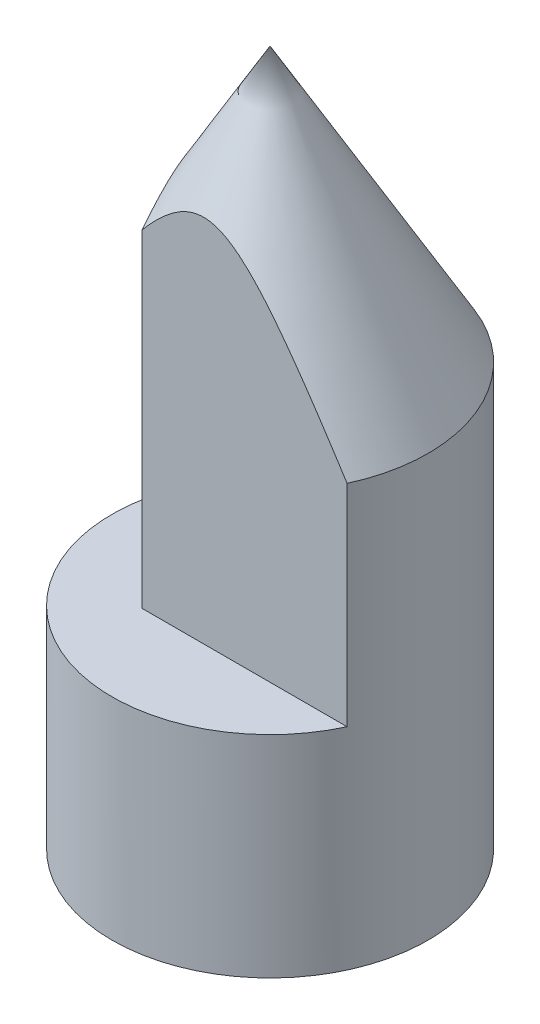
ISO-10303-21;
HEADER;
FILE_DESCRIPTION(('STEP AP214'),'2;1');
FILE_NAME('part.step','',(''),(''),'','','');
FILE_SCHEMA(('AUTOMOTIVE_DESIGN { 1 0 10303 214 1 1 1 1 }'));
ENDSEC;
DATA;
#1=APPLICATION_CONTEXT('core data for automotive mechanical design processes');
#2=APPLICATION_PROTOCOL_DEFINITION('international standard','automotive_design',2000,#1);
#3=PRODUCT_CONTEXT('',#1,'mechanical');
#4=PRODUCT('Part','Part','',(#3));
#5=PRODUCT_RELATED_PRODUCT_CATEGORY('part','',(#4));
#6=PRODUCT_DEFINITION_FORMATION('','',#4);
#7=PRODUCT_DEFINITION_CONTEXT('part definition',#1,'design');
#8=PRODUCT_DEFINITION('design','',#6,#7);
#9=PRODUCT_DEFINITION_SHAPE('','',#8);
#10=(LENGTH_UNIT() NAMED_UNIT(*) SI_UNIT(.MILLI.,.METRE.));
#11=(NAMED_UNIT(*) PLANE_ANGLE_UNIT() SI_UNIT($,.RADIAN.));
#12=(NAMED_UNIT(*) SI_UNIT($,.STERADIAN.) SOLID_ANGLE_UNIT());
#13=UNCERTAINTY_MEASURE_WITH_UNIT(LENGTH_MEASURE(1.E-05),#10,'distance_accuracy_value','');
#14=(GEOMETRIC_REPRESENTATION_CONTEXT(3) GLOBAL_UNCERTAINTY_ASSIGNED_CONTEXT((#13)) GLOBAL_UNIT_ASSIGNED_CONTEXT((#10,
#11,#12)) REPRESENTATION_CONTEXT('',''));
#15=CARTESIAN_POINT('',(0.,0.,0.));
#16=DIRECTION('',(0.,0.,1.));
#17=DIRECTION('',(1.,0.,0.));
#18=AXIS2_PLACEMENT_3D('',#15,#16,#17);
#19=CARTESIAN_POINT('',(0.,40.,0.));
#20=DIRECTION('',(0.,-1.,0.));
#21=DIRECTION('',(0.,0.,-1.));
#22=AXIS2_PLACEMENT_3D('',#19,#20,#21);
#23=CYLINDRICAL_SURFACE('',#22,15.);
#24=CARTESIAN_POINT('',(0.,0.,0.));
#25=DIRECTION('',(0.,1.,0.));
#26=DIRECTION('',(0.,0.,1.));
#27=AXIS2_PLACEMENT_3D('',#24,#25,#26);
#28=CIRCLE('',#27,15.);
#29=CARTESIAN_POINT('',(0.,0.,15.));
#30=VERTEX_POINT('',#29);
#31=EDGE_CURVE('E276',#30,#30,#28,.T.);
#32=ORIENTED_EDGE('',*,*,#31,.T.);
#33=EDGE_LOOP('',(#32));
#34=FACE_BOUND('',#33,.T.);
#35=DIRECTION('',(0.,-1.,0.));
#36=VECTOR('',#35,1.);
#37=CARTESIAN_POINT('',(13.6114090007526,40.,6.303137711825));
#38=LINE('',#37,#36);
#39=CARTESIAN_POINT('',(13.6114090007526,20.,6.303137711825));
#40=VERTEX_POINT('',#39);
#41=CARTESIAN_POINT('',(13.6114090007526,40.,6.303137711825));
#42=VERTEX_POINT('',#41);
#43=EDGE_CURVE('E274',#40,#42,#38,.F.);
#44=ORIENTED_EDGE('',*,*,#43,.F.);
#45=CARTESIAN_POINT('',(0.,20.,0.));
#46=DIRECTION('',(0.,1.,0.));
#47=DIRECTION('',(0.,0.,1.));
#48=AXIS2_PLACEMENT_3D('',#45,#46,#47);
#49=CIRCLE('',#48,15.);
#50=CARTESIAN_POINT('',(-6.38000784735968,20.,-13.5755478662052));
#51=VERTEX_POINT('',#50);
#52=EDGE_CURVE('E12',#51,#40,#49,.T.);
#53=ORIENTED_EDGE('',*,*,#52,.F.);
#54=DIRECTION('',(0.,-1.,0.));
#55=VECTOR('',#54,1.);
#56=CARTESIAN_POINT('',(-6.38000784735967,40.,-13.5755478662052));
#57=LINE('',#56,#55);
#58=CARTESIAN_POINT('',(-6.38000784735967,40.,-13.5755478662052));
#59=VERTEX_POINT('',#58);
#60=EDGE_CURVE('E263',#59,#51,#57,.T.);
#61=ORIENTED_EDGE('',*,*,#60,.F.);
#62=CARTESIAN_POINT('',(0.,40.,0.));
#63=DIRECTION('',(0.,1.,0.));
#64=DIRECTION('',(0.,0.,1.));
#65=AXIS2_PLACEMENT_3D('',#62,#63,#64);
#66=CIRCLE('',#65,15.);
#67=EDGE_CURVE('E277',#42,#59,#66,.T.);
#68=ORIENTED_EDGE('',*,*,#67,.F.);
#69=EDGE_LOOP('',(#44,#53,#61,#68));
#70=FACE_BOUND('',#69,.T.);
#71=ADVANCED_FACE('F211',(#34,#70),#23,.T.);
#72=CARTESIAN_POINT('',(0.,65.9807621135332,0.));
#73=DIRECTION('',(0.,-1.,0.));
#74=DIRECTION('',(0.,0.,-1.));
#75=AXIS2_PLACEMENT_3D('',#72,#73,#74);
#76=CONICAL_SURFACE('',#75,0.,0.523598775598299);
#77=CARTESIAN_POINT('',(0.,65.9807621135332,0.));
#78=VERTEX_POINT('',#77);
#79=VERTEX_LOOP('',#78);
#80=FACE_BOUND('',#79,.T.);
#81=CARTESIAN_POINT('',(-33.9912809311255,6.10246743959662,6.303137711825));
#82=CARTESIAN_POINT('',(-33.5140429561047,6.91520945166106,6.303137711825));
#83=CARTESIAN_POINT('',(-33.0365595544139,7.72780733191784,6.303137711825));
#84=CARTESIAN_POINT('',(-32.0810270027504,9.35267068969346,6.303137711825));
#85=CARTESIAN_POINT('',(-31.6029778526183,10.1649361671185,6.303137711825));
#86=CARTESIAN_POINT('',(-30.1678376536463,12.6012217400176,6.303137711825));
#87=CARTESIAN_POINT('',(-29.2097859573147,14.224676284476,6.303137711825));
#88=CARTESIAN_POINT('',(-27.2890141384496,17.4717105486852,6.303137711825));
#89=CARTESIAN_POINT('',(-26.326289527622,19.0952876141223,6.303137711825));
#90=CARTESIAN_POINT('',(-24.3962025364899,22.3396209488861,6.303137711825));
#91=CARTESIAN_POINT('',(-23.4288402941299,23.9603773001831,6.303137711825));
#92=CARTESIAN_POINT('',(-21.9550116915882,26.4181362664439,6.303137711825));
#93=CARTESIAN_POINT('',(-21.4509909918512,27.2566053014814,6.303137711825));
#94=CARTESIAN_POINT('',(-20.4407321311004,28.9322065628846,6.303137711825));
#95=CARTESIAN_POINT('',(-19.9344939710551,29.7693387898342,6.303137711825));
#96=CARTESIAN_POINT('',(-18.9192168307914,31.4420118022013,6.303137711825));
#97=CARTESIAN_POINT('',(-18.4101775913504,32.2775524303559,6.303137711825));
#98=CARTESIAN_POINT('',(-17.3886162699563,33.9464979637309,6.303137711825));
#99=CARTESIAN_POINT('',(-16.8760942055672,34.7799028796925,6.303137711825));
#100=CARTESIAN_POINT('',(-15.8469183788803,36.4433204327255,6.303137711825));
#101=CARTESIAN_POINT('',(-15.3302678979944,37.2733350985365,6.303137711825));
#102=CARTESIAN_POINT('',(-14.2910196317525,38.9296331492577,6.303137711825));
#103=CARTESIAN_POINT('',(-13.7684218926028,39.7559165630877,6.303137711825));
#104=CARTESIAN_POINT('',(-12.9784353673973,40.9913662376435,6.303137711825));
#105=CARTESIAN_POINT('',(-12.7141102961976,41.402491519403,6.303137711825));
#106=CARTESIAN_POINT('',(-12.1830226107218,42.2231638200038,6.303137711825));
#107=CARTESIAN_POINT('',(-11.9162600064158,42.632710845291,6.303137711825));
#108=CARTESIAN_POINT('',(-11.3798248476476,43.4498721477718,6.303137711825));
#109=CARTESIAN_POINT('',(-11.1101524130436,43.8574865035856,6.303137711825));
#110=CARTESIAN_POINT('',(-10.5672632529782,44.6703458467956,6.303137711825));
#111=CARTESIAN_POINT('',(-10.2940465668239,45.0755908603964,6.303137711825));
#112=CARTESIAN_POINT('',(-9.82810984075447,45.7586689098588,6.303137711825));
#113=CARTESIAN_POINT('',(-9.63653079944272,46.0372800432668,6.303137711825));
#114=CARTESIAN_POINT('',(-9.25092007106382,46.5928071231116,6.303137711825));
#115=CARTESIAN_POINT('',(-9.05688835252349,46.8697230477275,6.303137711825));
#116=CARTESIAN_POINT('',(-8.66586699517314,47.4216178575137,6.303137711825));
#117=CARTESIAN_POINT('',(-8.46887626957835,47.6965959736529,6.303137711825));
#118=CARTESIAN_POINT('',(-8.07146266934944,48.2440596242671,6.303137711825));
#119=CARTESIAN_POINT('',(-7.87103983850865,48.5165451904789,6.303137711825));
#120=CARTESIAN_POINT('',(-7.46657186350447,49.057749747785,6.303137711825));
#121=CARTESIAN_POINT('',(-7.26253713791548,49.326476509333,6.303137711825));
#122=CARTESIAN_POINT('',(-6.84946379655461,49.8600534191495,6.303137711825));
#123=CARTESIAN_POINT('',(-6.64042535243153,50.124903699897,6.303137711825));
#124=CARTESIAN_POINT('',(-6.21626814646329,50.6494718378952,6.303137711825));
#125=CARTESIAN_POINT('',(-6.00115268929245,50.9091923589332,6.303137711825));
#126=CARTESIAN_POINT('',(-5.56318595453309,51.4220040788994,6.303137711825));
#127=CARTESIAN_POINT('',(-5.34033590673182,51.6750963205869,6.303137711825));
#128=CARTESIAN_POINT('',(-4.94809416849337,52.1030545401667,6.303137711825));
#129=CARTESIAN_POINT('',(-4.7810792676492,52.2800937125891,6.303137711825));
#130=CARTESIAN_POINT('',(-4.44075893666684,52.6281231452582,6.303137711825));
#131=CARTESIAN_POINT('',(-4.26745230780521,52.7991122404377,6.303137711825));
#132=CARTESIAN_POINT('',(-3.91334524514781,53.1329885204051,6.303137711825));
#133=CARTESIAN_POINT('',(-3.73254916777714,53.2958802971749,6.303137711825));
#134=CARTESIAN_POINT('',(-3.36177859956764,53.610843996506,6.303137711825));
#135=CARTESIAN_POINT('',(-3.17180803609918,53.7629204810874,6.303137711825));
#136=CARTESIAN_POINT('',(-2.85712687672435,53.9956251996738,6.303137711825));
#137=CARTESIAN_POINT('',(-2.73591486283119,54.0809558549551,6.303137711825));
#138=CARTESIAN_POINT('',(-2.4889626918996,54.2447359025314,6.303137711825));
#139=CARTESIAN_POINT('',(-2.36322204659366,54.3231845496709,6.303137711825));
#140=CARTESIAN_POINT('',(-1.97878795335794,54.5456924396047,6.303137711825));
#141=CARTESIAN_POINT('',(-1.71234343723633,54.6773290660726,6.303137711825));
#142=CARTESIAN_POINT('',(-1.33293911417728,54.8233261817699,6.303137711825));
#143=CARTESIAN_POINT('',(-1.22823785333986,54.8595356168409,6.303137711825));
#144=CARTESIAN_POINT('',(-1.01639500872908,54.9238536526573,6.303137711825));
#145=CARTESIAN_POINT('',(-0.909254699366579,54.9519663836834,6.303137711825));
#146=CARTESIAN_POINT('',(-0.693119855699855,54.9991659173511,6.303137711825));
#147=CARTESIAN_POINT('',(-0.584127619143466,55.0182631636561,6.303137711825));
#148=CARTESIAN_POINT('',(-0.36487137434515,55.0467696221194,6.303137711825));
#149=CARTESIAN_POINT('',(-0.254607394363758,55.0561790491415,6.303137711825));
#150=CARTESIAN_POINT('',(-0.0331570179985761,55.0649476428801,6.303137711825));
#151=CARTESIAN_POINT('',(0.0780312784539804,55.0642594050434,6.303137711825));
#152=CARTESIAN_POINT('',(0.299874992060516,55.0527465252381,6.303137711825));
#153=CARTESIAN_POINT('',(0.410530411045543,55.0419219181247,6.303137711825));
#154=CARTESIAN_POINT('',(0.630489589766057,55.0105697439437,6.303137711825));
#155=CARTESIAN_POINT('',(0.739792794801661,54.990038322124,6.303137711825));
#156=CARTESIAN_POINT('',(0.956343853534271,54.9400270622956,6.303137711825));
#157=CARTESIAN_POINT('',(1.06359101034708,54.9105442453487,6.303137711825));
#158=CARTESIAN_POINT('',(1.31551303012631,54.8309365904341,6.303137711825));
#159=CARTESIAN_POINT('',(1.45905406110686,54.7772201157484,6.303137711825));
#160=CARTESIAN_POINT('',(1.740754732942,54.6571900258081,6.303137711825));
#161=CARTESIAN_POINT('',(1.87891166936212,54.5908701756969,6.303137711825));
#162=CARTESIAN_POINT('',(2.15028837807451,54.4477855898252,6.303137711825));
#163=CARTESIAN_POINT('',(2.28348869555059,54.3709842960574,6.303137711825));
#164=CARTESIAN_POINT('',(2.54470965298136,54.2091576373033,6.303137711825));
#165=CARTESIAN_POINT('',(2.67273128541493,54.1241338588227,6.303137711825));
#166=CARTESIAN_POINT('',(2.98331634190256,53.9058573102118,6.303137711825));
#167=CARTESIAN_POINT('',(3.16316475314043,53.7687522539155,6.303137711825));
#168=CARTESIAN_POINT('',(3.51437487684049,53.4840053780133,6.303137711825));
#169=CARTESIAN_POINT('',(3.68573140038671,53.3363572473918,6.303137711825));
#170=CARTESIAN_POINT('',(4.02164805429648,53.0328705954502,6.303137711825));
#171=CARTESIAN_POINT('',(4.18619300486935,52.8770153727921,6.303137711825));
#172=CARTESIAN_POINT('',(4.50926224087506,52.5592875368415,6.303137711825));
#173=CARTESIAN_POINT('',(4.66778779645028,52.397416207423,6.303137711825));
#174=CARTESIAN_POINT('',(4.98178924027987,52.0668800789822,6.303137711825));
#175=CARTESIAN_POINT('',(5.13720203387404,51.898155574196,6.303137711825));
#176=CARTESIAN_POINT('',(5.44372055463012,51.55683767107,6.303137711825));
#177=CARTESIAN_POINT('',(5.59482608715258,51.3842440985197,6.303137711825));
#178=CARTESIAN_POINT('',(5.89317765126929,51.0361692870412,6.303137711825));
#179=CARTESIAN_POINT('',(6.04042867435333,50.8606923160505,6.303137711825));
#180=CARTESIAN_POINT('',(6.33180916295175,50.5071831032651,6.303137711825));
#181=CARTESIAN_POINT('',(6.47593875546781,50.3291509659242,6.303137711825));
#182=CARTESIAN_POINT('',(6.79311785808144,49.9313214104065,6.303137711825));
#183=CARTESIAN_POINT('',(6.96550923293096,49.710999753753,6.303137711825));
#184=CARTESIAN_POINT('',(7.30693296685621,49.267765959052,6.303137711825));
#185=CARTESIAN_POINT('',(7.47596523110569,49.0448537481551,6.303137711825));
#186=CARTESIAN_POINT('',(7.97884359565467,48.3728846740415,6.303137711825));
#187=CARTESIAN_POINT('',(8.30843392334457,47.9206427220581,6.303137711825));
#188=CARTESIAN_POINT('',(8.95937203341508,47.0100037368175,6.303137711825));
#189=CARTESIAN_POINT('',(9.28071616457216,46.5516041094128,6.303137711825));
#190=CARTESIAN_POINT('',(9.9170056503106,45.6303762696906,6.303137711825));
#191=CARTESIAN_POINT('',(10.2319508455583,45.1675479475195,6.303137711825));
#192=CARTESIAN_POINT('',(10.8575607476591,44.2374604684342,6.303137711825));
#193=CARTESIAN_POINT('',(11.168213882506,43.7701935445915,6.303137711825));
#194=CARTESIAN_POINT('',(11.7855208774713,42.8330198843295,6.303137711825));
#195=CARTESIAN_POINT('',(12.0921746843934,42.3631131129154,6.303137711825));
#196=CARTESIAN_POINT('',(12.7021560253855,41.4213310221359,6.303137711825));
#197=CARTESIAN_POINT('',(13.0054844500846,40.9494562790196,6.303137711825));
#198=CARTESIAN_POINT('',(13.6094745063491,40.0040032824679,6.303137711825));
#199=CARTESIAN_POINT('',(13.9101361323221,39.5304250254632,6.303137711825));
#200=CARTESIAN_POINT('',(14.740911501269,38.2150942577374,6.303137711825));
#201=CARTESIAN_POINT('',(15.2686562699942,37.3718457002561,6.303137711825));
#202=CARTESIAN_POINT('',(16.3190483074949,35.6820917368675,6.303137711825));
#203=CARTESIAN_POINT('',(16.8416951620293,34.8355860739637,6.303137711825));
#204=CARTESIAN_POINT('',(17.8809428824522,33.1436021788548,6.303137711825));
#205=CARTESIAN_POINT('',(18.3975596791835,32.2981337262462,6.303137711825));
#206=CARTESIAN_POINT('',(19.1701697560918,31.0285793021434,6.303137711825));
#207=CARTESIAN_POINT('',(19.4273083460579,30.6051894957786,6.303137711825));
#208=CARTESIAN_POINT('',(19.9409007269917,29.7579953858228,6.303137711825));
#209=CARTESIAN_POINT('',(20.1973545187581,29.3341910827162,6.303137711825));
#210=CARTESIAN_POINT('',(20.4535054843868,28.9102037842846,6.303137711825));
#211=B_SPLINE_CURVE_WITH_KNOTS('',3,(#81,#82,#83,#84,#85,#86,#87,#88,#89,#90,#91,#92,#93,#94,
#95,#96,#97,#98,#99,#100,#101,#102,#103,#104,#105,#106,#107,#108,#109,#110,#111,#112,#113,#114,
#115,#116,#117,#118,#119,#120,#121,#122,#123,#124,#125,#126,#127,#128,#129,#130,#131,#132,#133,
#134,#135,#136,#137,#138,#139,#140,#141,#142,#143,#144,#145,#146,#147,#148,#149,#150,#151,#152,
#153,#154,#155,#156,#157,#158,#159,#160,#161,#162,#163,#164,#165,#166,#167,#168,#169,#170,#171,
#172,#173,#174,#175,#176,#177,#178,#179,#180,#181,#182,#183,#184,#185,#186,#187,#188,#189,#190,
#191,#192,#193,#194,#195,#196,#197,#198,#199,#200,#201,#202,#203,#204,#205,#206,#207,#208,#209,
#210),.UNSPECIFIED.,.F.,.F.,(4,2,2,2,2,2,2,2,2,2,2,2,2,2,2,2,2,2,2,2,2,2,2,2,2,2,2,2,2,2,2,2,2,
2,2,2,2,2,2,2,2,2,2,2,2,2,2,2,2,2,2,2,2,2,2,2,2,2,2,2,2,2,2,2,4),(0.,2.82749895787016,
5.65499871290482,11.3101884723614,16.9728306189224,22.635305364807,25.5701970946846,
28.5050875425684,31.4402543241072,34.3754063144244,37.3084203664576,40.2414116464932,
41.7077015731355,43.1739855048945,44.6402092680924,46.1064167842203,47.120773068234,
48.1351423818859,49.1498938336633,50.1646323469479,51.176809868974,52.1889527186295,
53.2005553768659,54.2119979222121,54.9420374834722,55.6722168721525,56.4019773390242,
57.131428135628,57.5759060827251,58.0204320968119,58.9074531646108,59.2395599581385,
59.5714970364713,59.9030486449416,60.2345928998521,60.5676941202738,60.9007941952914,
61.2340266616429,61.5673701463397,62.0263929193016,62.4856433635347,62.9465386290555,
63.4073451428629,64.0852176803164,64.7634994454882,65.4432192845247,66.1227948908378,
66.8108849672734,67.4990060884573,68.186186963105,68.8733398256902,69.7125508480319,
70.5517855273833,72.230435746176,73.9098168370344,75.5892396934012,77.2725430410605,
78.9558687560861,80.6387320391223,82.3215988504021,85.3059035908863,88.290448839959,
91.2628781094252,92.7489505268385,94.2350212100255),.UNSPECIFIED.);
#212=CARTESIAN_POINT('',(-5.85074537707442,51.0850479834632,6.303137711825));
#213=VERTEX_POINT('',#212);
#214=EDGE_CURVE('E218',#42,#213,#211,.F.);
#215=ORIENTED_EDGE('',*,*,#214,.F.);
#216=ORIENTED_EDGE('',*,*,#67,.T.);
#217=CARTESIAN_POINT('',(-43.4114371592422,-12.8008672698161,-13.5755478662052));
#218=CARTESIAN_POINT('',(-42.8974251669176,-11.9511565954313,-13.5755478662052));
#219=CARTESIAN_POINT('',(-42.3828228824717,-11.1018030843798,-13.5755478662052));
#220=CARTESIAN_POINT('',(-41.3522934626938,-9.40389908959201,-13.5755478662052));
#221=CARTESIAN_POINT('',(-40.8363663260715,-8.55534860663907,-13.5755478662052));
#222=CARTESIAN_POINT('',(-39.2863267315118,-6.01094529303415,-13.5755478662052));
#223=CARTESIAN_POINT('',(-38.2500117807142,-4.31643273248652,-13.5755478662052));
#224=CARTESIAN_POINT('',(-36.1667750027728,-0.926709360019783,-13.5755478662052));
#225=CARTESIAN_POINT('',(-35.1198302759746,0.768487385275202,-13.5755478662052));
#226=CARTESIAN_POINT('',(-33.0164394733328,4.15288663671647,-13.5755478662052));
#227=CARTESIAN_POINT('',(-31.9599938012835,5.84208939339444,-13.5755478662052));
#228=CARTESIAN_POINT('',(-30.2960025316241,8.48071566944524,-13.5755478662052));
#229=CARTESIAN_POINT('',(-29.6927441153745,9.43284266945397,-13.5755478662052));
#230=CARTESIAN_POINT('',(-28.4814248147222,11.3340423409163,-13.5755478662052));
#231=CARTESIAN_POINT('',(-27.8733639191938,12.2831150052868,-13.5755478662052));
#232=CARTESIAN_POINT('',(-26.6514128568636,14.1776990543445,-13.5755478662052));
#233=CARTESIAN_POINT('',(-26.037521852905,15.1232098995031,-13.5755478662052));
#234=CARTESIAN_POINT('',(-24.8027861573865,17.0096773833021,-13.5755478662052));
#235=CARTESIAN_POINT('',(-24.1819415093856,17.9506340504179,-13.5755478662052));
#236=CARTESIAN_POINT('',(-22.9329708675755,19.8249522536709,-13.5755478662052));
#237=CARTESIAN_POINT('',(-22.3048622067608,20.7583253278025,-13.5755478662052));
#238=CARTESIAN_POINT('',(-21.0380039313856,22.6178833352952,-13.5755478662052));
#239=CARTESIAN_POINT('',(-20.3992540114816,23.5440680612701,-13.5755478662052));
#240=CARTESIAN_POINT('',(-19.4310524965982,24.9261123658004,-13.5755478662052));
#241=CARTESIAN_POINT('',(-19.1066801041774,25.3855317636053,-13.5755478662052));
#242=CARTESIAN_POINT('',(-18.4540693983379,26.3016148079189,-13.5755478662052));
#243=CARTESIAN_POINT('',(-18.1258311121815,26.7582784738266,-13.5755478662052));
#244=CARTESIAN_POINT('',(-17.4649493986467,27.6683699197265,-13.5755478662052));
#245=CARTESIAN_POINT('',(-17.1323062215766,28.1217978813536,-13.5755478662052));
#246=CARTESIAN_POINT('',(-16.4619251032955,29.0248673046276,-13.5755478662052));
#247=CARTESIAN_POINT('',(-16.12418724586,29.4745088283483,-13.5755478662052));
#248=CARTESIAN_POINT('',(-15.5964061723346,30.1675580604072,-13.5755478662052));
#249=CARTESIAN_POINT('',(-15.4084314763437,30.4125418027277,-13.5755478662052));
#250=CARTESIAN_POINT('',(-15.0305317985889,30.9009997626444,-13.5755478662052));
#251=CARTESIAN_POINT('',(-14.84060681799,31.1444739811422,-13.5755478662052));
#252=CARTESIAN_POINT('',(-14.267625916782,31.8724153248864,-13.5755478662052));
#253=CARTESIAN_POINT('',(-13.881379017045,32.3543814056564,-13.5755478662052));
#254=CARTESIAN_POINT('',(-13.0976880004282,33.3111688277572,-13.5755478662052));
#255=CARTESIAN_POINT('',(-12.7002182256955,33.7859692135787,-13.5755478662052));
#256=CARTESIAN_POINT('',(-11.8928135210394,34.7248053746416,-13.5755478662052));
#257=CARTESIAN_POINT('',(-11.4828797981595,35.1888421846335,-13.5755478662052));
#258=CARTESIAN_POINT('',(-10.6559546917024,36.0937740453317,-13.5755478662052));
#259=CARTESIAN_POINT('',(-10.2392693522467,36.5349464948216,-13.5755478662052));
#260=CARTESIAN_POINT('',(-9.60034894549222,37.183233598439,-13.5755478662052));
#261=CARTESIAN_POINT('',(-9.38499889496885,37.3971410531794,-13.5755478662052));
#262=CARTESIAN_POINT('',(-8.94913850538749,37.8196232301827,-13.5755478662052));
#263=CARTESIAN_POINT('',(-8.72862846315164,38.0281982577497,-13.5755478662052));
#264=CARTESIAN_POINT('',(-8.28269329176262,38.4382703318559,-13.5755478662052));
#265=CARTESIAN_POINT('',(-8.05729067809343,38.6397918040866,-13.5755478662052));
#266=CARTESIAN_POINT('',(-7.60003356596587,39.0354412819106,-13.5755478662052));
#267=CARTESIAN_POINT('',(-7.36817855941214,39.22956870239,-13.5755478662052));
#268=CARTESIAN_POINT('',(-6.8975139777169,39.6087407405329,-13.5755478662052));
#269=CARTESIAN_POINT('',(-6.65871153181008,39.7937941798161,-13.5755478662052));
#270=CARTESIAN_POINT('',(-6.1731760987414,40.1531357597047,-13.5755478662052));
#271=CARTESIAN_POINT('',(-5.92644518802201,40.327426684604,-13.5755478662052));
#272=CARTESIAN_POINT('',(-5.5458858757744,40.5816614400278,-13.5755478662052));
#273=CARTESIAN_POINT('',(-5.41525985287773,40.666411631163,-13.5755478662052));
#274=CARTESIAN_POINT('',(-5.15158436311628,40.8320509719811,-13.5755478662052));
#275=CARTESIAN_POINT('',(-5.01853488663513,40.9129401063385,-13.5755478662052));
#276=CARTESIAN_POINT('',(-4.61552713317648,41.1492514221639,-13.5755478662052));
#277=CARTESIAN_POINT('',(-4.34175792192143,41.298284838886,-13.5755478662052));
#278=CARTESIAN_POINT('',(-3.78462273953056,41.5749497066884,-13.5755478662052));
#279=CARTESIAN_POINT('',(-3.50128998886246,41.7026475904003,-13.5755478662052));
#280=CARTESIAN_POINT('',(-2.9244932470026,41.9327132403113,-13.5755478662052));
#281=CARTESIAN_POINT('',(-2.6310337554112,42.0350920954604,-13.5755478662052));
#282=CARTESIAN_POINT('',(-2.11227467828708,42.1872896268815,-13.5755478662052));
#283=CARTESIAN_POINT('',(-1.88895090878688,42.2438539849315,-13.5755478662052));
#284=CARTESIAN_POINT('',(-1.43845073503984,42.3387635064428,-13.5755478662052));
#285=CARTESIAN_POINT('',(-1.21127489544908,42.3771113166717,-13.5755478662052));
#286=CARTESIAN_POINT('',(-0.754742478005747,42.4342096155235,-13.5755478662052));
#287=CARTESIAN_POINT('',(-0.525388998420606,42.4529846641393,-13.5755478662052));
#288=CARTESIAN_POINT('',(-0.0659083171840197,42.4703115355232,-13.5755478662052));
#289=CARTESIAN_POINT('',(0.16421889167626,42.4688631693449,-13.5755478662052));
#290=CARTESIAN_POINT('',(0.62287116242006,42.4458276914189,-13.5755478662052));
#291=CARTESIAN_POINT('',(0.85139879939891,42.424291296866,-13.5755478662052));
#292=CARTESIAN_POINT('',(1.30579632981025,42.3619589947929,-13.5755478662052));
#293=CARTESIAN_POINT('',(1.53166609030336,42.3211621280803,-13.5755478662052));
#294=CARTESIAN_POINT('',(1.98072631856,42.221413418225,-13.5755478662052));
#295=CARTESIAN_POINT('',(2.20389314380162,42.162355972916,-13.5755478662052));
#296=CARTESIAN_POINT('',(2.64520518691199,42.0279712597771,-13.5755478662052));
#297=CARTESIAN_POINT('',(2.86335061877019,41.9526446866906,-13.5755478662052));
#298=CARTESIAN_POINT('',(3.42649512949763,41.7369153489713,-13.5755478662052));
#299=CARTESIAN_POINT('',(3.76708673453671,41.5849644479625,-13.5755478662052));
#300=CARTESIAN_POINT('',(4.43366284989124,41.2511806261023,-13.5755478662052));
#301=CARTESIAN_POINT('',(4.75962303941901,41.0693001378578,-13.5755478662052));
#302=CARTESIAN_POINT('',(5.39199699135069,40.6855304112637,-13.5755478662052));
#303=CARTESIAN_POINT('',(5.69864637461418,40.4840263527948,-13.5755478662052));
#304=CARTESIAN_POINT('',(6.14867896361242,40.168959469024,-13.5755478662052));
#305=CARTESIAN_POINT('',(6.29676750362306,40.0620121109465,-13.5755478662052));
#306=CARTESIAN_POINT('',(6.59000238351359,39.8442288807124,-13.5755478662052));
#307=CARTESIAN_POINT('',(6.73514944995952,39.7333939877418,-13.5755478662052));
#308=CARTESIAN_POINT('',(6.87894472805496,39.6208277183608,-13.5755478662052));
#309=B_SPLINE_CURVE_WITH_KNOTS('',3,(#217,#218,#219,#220,#221,#222,#223,#224,#225,#226,#227,
#228,#229,#230,#231,#232,#233,#234,#235,#236,#237,#238,#239,#240,#241,#242,#243,#244,#245,#246,
#247,#248,#249,#250,#251,#252,#253,#254,#255,#256,#257,#258,#259,#260,#261,#262,#263,#264,#265,
#266,#267,#268,#269,#270,#271,#272,#273,#274,#275,#276,#277,#278,#279,#280,#281,#282,#283,#284,
#285,#286,#287,#288,#289,#290,#291,#292,#293,#294,#295,#296,#297,#298,#299,#300,#301,#302,#303,
#304,#305,#306,#307,#308),.UNSPECIFIED.,.F.,.F.,(4,2,2,2,2,2,2,2,2,2,2,2,2,2,2,2,2,2,2,2,2,2,2,
2,2,2,2,2,2,2,2,2,2,2,2,2,2,2,2,2,2,2,2,2,2,4),(0.,2.97925257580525,5.95850805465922,
11.9173419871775,17.8946160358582,23.8716372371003,27.2530752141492,30.6345210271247,
34.0164599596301,37.3983777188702,40.7734324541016,44.1485842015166,45.835741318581,
47.5228865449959,49.2099363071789,50.896958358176,51.8233207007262,52.7496824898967,
54.6024803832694,56.4599260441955,58.3171923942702,60.1372408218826,61.0477663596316,
61.9582396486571,62.8651630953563,63.7721581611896,64.6782532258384,65.5841128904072,
66.0511843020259,66.5182575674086,67.4525789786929,68.3839346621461,69.3148817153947,
70.0053402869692,70.6956985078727,71.3851894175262,72.0746867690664,72.7624480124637,
73.4502435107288,74.1420934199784,74.833913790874,75.9507847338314,77.0694481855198,
78.1694167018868,78.7173728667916,79.2651919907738),.UNSPECIFIED.);
#310=CARTESIAN_POINT('',(-5.85074537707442,40.3764623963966,-13.5755478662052));
#311=VERTEX_POINT('',#310);
#312=EDGE_CURVE('E289',#311,#59,#309,.F.);
#313=ORIENTED_EDGE('',*,*,#312,.F.);
#314=CARTESIAN_POINT('',(-5.85074537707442,28.8511280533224,-20.6229327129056));
#315=CARTESIAN_POINT('',(-5.85074537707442,29.466301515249,-20.2537339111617));
#316=CARTESIAN_POINT('',(-5.85074537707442,30.0811594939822,-19.8840083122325));
#317=CARTESIAN_POINT('',(-5.85074537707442,31.3101064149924,-19.1432757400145));
#318=CARTESIAN_POINT('',(-5.85074537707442,31.9241953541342,-18.7722687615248));
#319=CARTESIAN_POINT('',(-5.85074537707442,33.1515567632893,-18.0286907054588));
#320=CARTESIAN_POINT('',(-5.85074537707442,33.7648290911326,-17.6561193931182));
#321=CARTESIAN_POINT('',(-5.85074537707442,34.990270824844,-16.9091686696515));
#322=CARTESIAN_POINT('',(-5.85074537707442,35.6024402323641,-16.5347892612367));
#323=CARTESIAN_POINT('',(-5.85074537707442,36.8290875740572,-15.7815936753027));
#324=CARTESIAN_POINT('',(-5.85074537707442,37.4435574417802,-15.4027643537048));
#325=CARTESIAN_POINT('',(-5.85074537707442,38.6708040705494,-14.6423734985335));
#326=CARTESIAN_POINT('',(-5.85074537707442,39.2835808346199,-14.2608119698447));
#327=CARTESIAN_POINT('',(-5.85074537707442,40.5069470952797,-13.4942968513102));
#328=CARTESIAN_POINT('',(-5.85074537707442,41.1175367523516,-13.109343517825));
#329=CARTESIAN_POINT('',(-5.85074537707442,42.3359434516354,-12.3350774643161));
#330=CARTESIAN_POINT('',(-5.85074537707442,42.9437605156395,-11.9457647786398));
#331=CARTESIAN_POINT('',(-5.85074537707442,44.1548308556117,-11.1620123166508));
#332=CARTESIAN_POINT('',(-5.85074537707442,44.7580894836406,-10.7675808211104));
#333=CARTESIAN_POINT('',(-5.85074537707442,45.9596427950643,-9.9710764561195));
#334=CARTESIAN_POINT('',(-5.85074537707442,46.5579370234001,-9.56900289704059));
#335=CARTESIAN_POINT('',(-5.85074537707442,47.4492968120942,-8.95836828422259));
#336=CARTESIAN_POINT('',(-5.85074537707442,47.7450912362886,-8.75379131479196));
#337=CARTESIAN_POINT('',(-5.85074537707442,48.3344495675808,-8.34145243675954));
#338=CARTESIAN_POINT('',(-5.85074537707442,48.62801350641,-8.13369057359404));
#339=CARTESIAN_POINT('',(-5.85074537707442,49.2123338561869,-7.7143382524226));
#340=CARTESIAN_POINT('',(-5.85074537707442,49.5030906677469,-7.50274835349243));
#341=CARTESIAN_POINT('',(-5.85074537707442,50.0810916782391,-7.07483271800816));
#342=CARTESIAN_POINT('',(-5.85074537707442,50.3683360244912,-6.85850718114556));
#343=CARTESIAN_POINT('',(-5.85074537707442,50.8572176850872,-6.48228728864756));
#344=CARTESIAN_POINT('',(-5.85074537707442,51.0599683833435,-6.32384101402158));
#345=CARTESIAN_POINT('',(-5.85074537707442,51.4626059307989,-6.00332565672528));
#346=CARTESIAN_POINT('',(-5.85074537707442,51.6624926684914,-5.84125643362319));
#347=CARTESIAN_POINT('',(-5.85074537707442,52.0592014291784,-5.51235310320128));
#348=CARTESIAN_POINT('',(-5.85074537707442,52.2560140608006,-5.34550763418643));
#349=CARTESIAN_POINT('',(-5.85074537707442,52.6450309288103,-5.00654335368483));
#350=CARTESIAN_POINT('',(-5.85074537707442,52.8372355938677,-4.83442503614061));
#351=CARTESIAN_POINT('',(-5.85074537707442,53.2221925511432,-4.47764592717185));
#352=CARTESIAN_POINT('',(-5.85074537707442,53.4147348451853,-4.29275727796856));
#353=CARTESIAN_POINT('',(-5.85074537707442,53.7912579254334,-3.91418450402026));
#354=CARTESIAN_POINT('',(-5.85074537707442,53.9752341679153,-3.72049581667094));
#355=CARTESIAN_POINT('',(-5.85074537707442,54.3304414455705,-3.32281108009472));
#356=CARTESIAN_POINT('',(-5.85074537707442,54.5017121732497,-3.11885078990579));
#357=CARTESIAN_POINT('',(-5.85074537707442,54.8266270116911,-2.69740250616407));
#358=CARTESIAN_POINT('',(-5.85074537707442,54.9802941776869,-2.47993279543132));
#359=CARTESIAN_POINT('',(-5.85074537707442,55.1814943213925,-2.15678119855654));
#360=CARTESIAN_POINT('',(-5.85074537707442,55.2397316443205,-2.0577710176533));
#361=CARTESIAN_POINT('',(-5.85074537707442,55.3503126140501,-1.85654026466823));
#362=CARTESIAN_POINT('',(-5.85074537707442,55.4026563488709,-1.75431974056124));
#363=CARTESIAN_POINT('',(-5.85074537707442,55.5491164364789,-1.44278274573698));
#364=CARTESIAN_POINT('',(-5.85074537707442,55.632877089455,-1.22825779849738));
#365=CARTESIAN_POINT('',(-5.85074537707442,55.7305018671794,-0.896422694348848));
#366=CARTESIAN_POINT('',(-5.85074537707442,55.7584827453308,-0.783183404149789));
#367=CARTESIAN_POINT('',(-5.85074537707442,55.8034610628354,-0.554504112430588));
#368=CARTESIAN_POINT('',(-5.85074537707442,55.8204595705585,-0.439064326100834));
#369=CARTESIAN_POINT('',(-5.85074537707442,55.8426053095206,-0.207153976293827));
#370=CARTESIAN_POINT('',(-5.85074537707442,55.847763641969,-0.0906844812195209));
#371=CARTESIAN_POINT('',(-5.85074537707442,55.8459879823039,0.142158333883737));
#372=CARTESIAN_POINT('',(-5.85074537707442,55.8390549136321,0.25853166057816));
#373=CARTESIAN_POINT('',(-5.85074537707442,55.8153895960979,0.472611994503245));
#374=CARTESIAN_POINT('',(-5.85074537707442,55.8002809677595,0.570503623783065));
#375=CARTESIAN_POINT('',(-5.85074537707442,55.76214204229,0.764745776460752));
#376=CARTESIAN_POINT('',(-5.85074537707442,55.7391088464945,0.861095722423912));
#377=CARTESIAN_POINT('',(-5.85074537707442,55.659174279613,1.14710218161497));
#378=CARTESIAN_POINT('',(-5.85074537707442,55.591430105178,1.3337791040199));
#379=CARTESIAN_POINT('',(-5.85074537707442,55.4430159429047,1.67560288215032));
#380=CARTESIAN_POINT('',(-5.85074537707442,55.3648196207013,1.83186876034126));
#381=CARTESIAN_POINT('',(-5.85074537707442,55.1950325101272,2.13704842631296));
#382=CARTESIAN_POINT('',(-5.85074537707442,55.1034305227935,2.28595592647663));
#383=CARTESIAN_POINT('',(-5.85074537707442,54.9096029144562,2.57756789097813));
#384=CARTESIAN_POINT('',(-5.85074537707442,54.8073312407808,2.72024134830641));
#385=CARTESIAN_POINT('',(-5.85074537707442,54.5949326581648,2.99947802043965));
#386=CARTESIAN_POINT('',(-5.85074537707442,54.4848089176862,3.1360436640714));
#387=CARTESIAN_POINT('',(-5.85074537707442,54.2685981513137,3.39190596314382));
#388=CARTESIAN_POINT('',(-5.85074537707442,54.163038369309,3.51165131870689));
#389=CARTESIAN_POINT('',(-5.85074537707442,53.9477935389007,3.74738595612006));
#390=CARTESIAN_POINT('',(-5.85074537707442,53.8381079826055,3.86337477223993));
#391=CARTESIAN_POINT('',(-5.85074537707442,53.5039120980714,4.20658335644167));
#392=CARTESIAN_POINT('',(-5.85074537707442,53.2743788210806,4.42891099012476));
#393=CARTESIAN_POINT('',(-5.85074537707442,52.8055695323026,4.86412064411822));
#394=CARTESIAN_POINT('',(-5.85074537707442,52.5662704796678,5.07697751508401));
#395=CARTESIAN_POINT('',(-5.85074537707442,52.081067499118,5.49484214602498));
#396=CARTESIAN_POINT('',(-5.85074537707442,51.8351655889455,5.69985225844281));
#397=CARTESIAN_POINT('',(-5.85074537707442,51.3359958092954,6.10565970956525));
#398=CARTESIAN_POINT('',(-5.85074537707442,51.082679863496,6.3063976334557));
#399=CARTESIAN_POINT('',(-5.85074537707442,50.5721350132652,6.70285515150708));
#400=CARTESIAN_POINT('',(-5.85074537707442,50.3149058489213,6.89857440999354));
#401=CARTESIAN_POINT('',(-5.85074537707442,49.7978040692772,7.28559887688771));
#402=CARTESIAN_POINT('',(-5.85074537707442,49.5379364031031,7.47691071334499));
#403=CARTESIAN_POINT('',(-5.85074537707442,49.0157605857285,7.85615011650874));
#404=CARTESIAN_POINT('',(-5.85074537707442,48.753452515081,8.0440777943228));
#405=CARTESIAN_POINT('',(-5.85074537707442,48.2220905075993,8.42047235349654));
#406=CARTESIAN_POINT('',(-5.85074537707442,47.9530002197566,8.60888785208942));
#407=CARTESIAN_POINT('',(-5.85074537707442,47.41310645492,8.98324986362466));
#408=CARTESIAN_POINT('',(-5.85074537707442,47.1423029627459,9.16919635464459));
#409=CARTESIAN_POINT('',(-5.85074537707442,46.3277372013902,9.7239154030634));
#410=CARTESIAN_POINT('',(-5.85074537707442,45.7818400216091,10.0895531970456));
#411=CARTESIAN_POINT('',(-5.85074537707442,44.685870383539,10.814688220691));
#412=CARTESIAN_POINT('',(-5.85074537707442,44.1357972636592,11.1741844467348));
#413=CARTESIAN_POINT('',(-5.85074537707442,43.032571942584,11.8884265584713));
#414=CARTESIAN_POINT('',(-5.85074537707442,42.479419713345,12.2431724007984));
#415=CARTESIAN_POINT('',(-5.85074537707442,41.3700067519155,12.949414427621));
#416=CARTESIAN_POINT('',(-5.85074537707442,40.8137428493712,13.300905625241));
#417=CARTESIAN_POINT('',(-5.85074537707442,39.6993418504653,14.0009091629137));
#418=CARTESIAN_POINT('',(-5.85074537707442,39.1412047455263,14.3494214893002));
#419=CARTESIAN_POINT('',(-5.85074537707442,38.0234852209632,15.043992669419));
#420=CARTESIAN_POINT('',(-5.85074537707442,37.4639029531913,15.3900517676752));
#421=CARTESIAN_POINT('',(-5.85074537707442,36.3435105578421,16.0801772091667));
#422=CARTESIAN_POINT('',(-5.85074537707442,35.7827004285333,16.4242435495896));
#423=CARTESIAN_POINT('',(-5.85074537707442,34.1809566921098,17.4037002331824));
#424=CARTESIAN_POINT('',(-5.85074537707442,33.1387935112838,18.0370796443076));
#425=CARTESIAN_POINT('',(-5.85074537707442,31.0519278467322,19.2997076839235));
#426=CARTESIAN_POINT('',(-5.85074537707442,30.0072252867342,19.9289561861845));
#427=CARTESIAN_POINT('',(-5.85074537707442,27.9180830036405,21.1830315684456));
#428=CARTESIAN_POINT('',(-5.85074537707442,26.8736471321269,21.8078648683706));
#429=CARTESIAN_POINT('',(-5.85074537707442,24.783346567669,23.0550484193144));
#430=CARTESIAN_POINT('',(-5.85074537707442,23.7374819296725,23.6773987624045));
#431=CARTESIAN_POINT('',(-5.85074537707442,22.6910858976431,24.2988504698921));
#432=B_SPLINE_CURVE_WITH_KNOTS('',3,(#314,#315,#316,#317,#318,#319,#320,#321,#322,#323,#324,
#325,#326,#327,#328,#329,#330,#331,#332,#333,#334,#335,#336,#337,#338,#339,#340,#341,#342,#343,
#344,#345,#346,#347,#348,#349,#350,#351,#352,#353,#354,#355,#356,#357,#358,#359,#360,#361,#362,
#363,#364,#365,#366,#367,#368,#369,#370,#371,#372,#373,#374,#375,#376,#377,#378,#379,#380,#381,
#382,#383,#384,#385,#386,#387,#388,#389,#390,#391,#392,#393,#394,#395,#396,#397,#398,#399,#400,
#401,#402,#403,#404,#405,#406,#407,#408,#409,#410,#411,#412,#413,#414,#415,#416,#417,#418,#419,
#420,#421,#422,#423,#424,#425,#426,#427,#428,#429,#430,#431),.UNSPECIFIED.,.F.,.F.,(4,2,2,2,2,2,
2,2,2,2,2,2,2,2,2,2,2,2,2,2,2,2,2,2,2,2,2,2,2,2,2,2,2,2,2,2,2,2,2,2,2,2,2,2,2,2,2,2,2,2,2,2,2,2,
2,2,2,2,4),(0.,2.15237494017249,4.30475862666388,6.45747777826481,8.6101937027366,
10.7757742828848,12.9413509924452,15.1067654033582,17.2721627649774,19.4344106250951,
21.5968545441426,22.6757799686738,23.7546900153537,24.8334437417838,25.9121520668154,
26.6840761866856,27.4560302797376,28.2300049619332,29.0039073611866,29.8045166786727,
30.6055459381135,31.4039570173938,32.2013101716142,32.5457299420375,32.8901445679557,
33.5777911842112,33.9272861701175,34.2767471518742,34.6258803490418,34.9749868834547,
35.2717935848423,35.5687089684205,36.1623490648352,36.685833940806,37.2097586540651,
37.7360464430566,38.2621230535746,38.7409012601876,39.2197385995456,40.1779451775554,
41.1385604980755,42.098885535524,43.0684389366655,44.0380570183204,45.0061066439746,
45.97412442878,46.9595975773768,47.9450794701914,49.9161179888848,51.8874755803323,
53.8588511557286,55.832866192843,57.8068902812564,59.7807147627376,61.7545420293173,
65.4131417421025,69.07185273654,72.7230633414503,76.3741372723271),.UNSPECIFIED.);
#433=EDGE_CURVE('E280',#311,#213,#432,.T.);
#434=ORIENTED_EDGE('',*,*,#433,.T.);
#435=EDGE_LOOP('',(#215,#216,#313,#434));
#436=FACE_BOUND('',#435,.T.);
#437=ADVANCED_FACE('F294',(#80,#436),#76,.T.);
#438=CARTESIAN_POINT('',(0.,0.,0.));
#439=DIRECTION('',(0.,1.,0.));
#440=DIRECTION('',(0.,0.,1.));
#441=AXIS2_PLACEMENT_3D('',#438,#439,#440);
#442=PLANE('',#441);
#443=ORIENTED_EDGE('',*,*,#31,.F.);
#444=EDGE_LOOP('',(#443));
#445=FACE_BOUND('',#444,.T.);
#446=ADVANCED_FACE('F313',(#445),#442,.F.);
#447=CARTESIAN_POINT('',(-43.4851452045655,20.,0.863794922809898));
#448=DIRECTION('',(0.,1.,0.));
#449=DIRECTION('',(0.,0.,1.));
#450=AXIS2_PLACEMENT_3D('',#447,#448,#449);
#451=PLANE('',#450);
#452=ORIENTED_EDGE('',*,*,#52,.T.);
#453=DIRECTION('',(-1.,0.,0.));
#454=VECTOR('',#453,1.);
#455=CARTESIAN_POINT('',(-43.4851452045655,20.,6.303137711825));
#456=LINE('',#455,#454);
#457=CARTESIAN_POINT('',(-5.85074537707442,20.,6.303137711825));
#458=VERTEX_POINT('',#457);
#459=EDGE_CURVE('E251',#40,#458,#456,.T.);
#460=ORIENTED_EDGE('',*,*,#459,.T.);
#461=DIRECTION('',(0.,0.,1.));
#462=VECTOR('',#461,1.);
#463=CARTESIAN_POINT('',(-5.85074537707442,20.,0.863794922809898));
#464=LINE('',#463,#462);
#465=CARTESIAN_POINT('',(-5.85074537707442,20.,-13.5755478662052));
#466=VERTEX_POINT('',#465);
#467=EDGE_CURVE('E254',#466,#458,#464,.T.);
#468=ORIENTED_EDGE('',*,*,#467,.F.);
#469=DIRECTION('',(-1.,0.,0.));
#470=VECTOR('',#469,1.);
#471=CARTESIAN_POINT('',(-43.4851452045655,20.,-13.5755478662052));
#472=LINE('',#471,#470);
#473=EDGE_CURVE('E268',#466,#51,#472,.T.);
#474=ORIENTED_EDGE('',*,*,#473,.T.);
#475=EDGE_LOOP('',(#452,#460,#468,#474));
#476=FACE_BOUND('',#475,.T.);
#477=ADVANCED_FACE('F252',(#476),#451,.T.);
#478=CARTESIAN_POINT('',(-43.4851452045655,68.,6.303137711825));
#479=DIRECTION('',(0.,0.,1.));
#480=DIRECTION('',(1.,0.,0.));
#481=AXIS2_PLACEMENT_3D('',#478,#479,#480);
#482=PLANE('',#481);
#483=ORIENTED_EDGE('',*,*,#43,.T.);
#484=ORIENTED_EDGE('',*,*,#214,.T.);
#485=DIRECTION('',(0.,-1.,0.));
#486=VECTOR('',#485,1.);
#487=CARTESIAN_POINT('',(-5.85074537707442,68.,6.303137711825));
#488=LINE('',#487,#486);
#489=EDGE_CURVE('E225',#213,#458,#488,.T.);
#490=ORIENTED_EDGE('',*,*,#489,.T.);
#491=ORIENTED_EDGE('',*,*,#459,.F.);
#492=EDGE_LOOP('',(#483,#484,#490,#491));
#493=FACE_BOUND('',#492,.T.);
#494=ADVANCED_FACE('F260',(#493),#482,.T.);
#495=CARTESIAN_POINT('',(-43.4851452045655,68.,-13.5755478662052));
#496=DIRECTION('',(0.,0.,1.));
#497=DIRECTION('',(1.,0.,0.));
#498=AXIS2_PLACEMENT_3D('',#495,#496,#497);
#499=PLANE('',#498);
#500=ORIENTED_EDGE('',*,*,#60,.T.);
#501=ORIENTED_EDGE('',*,*,#473,.F.);
#502=DIRECTION('',(0.,-1.,0.));
#503=VECTOR('',#502,1.);
#504=CARTESIAN_POINT('',(-5.85074537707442,68.,-13.5755478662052));
#505=LINE('',#504,#503);
#506=EDGE_CURVE('E258',#311,#466,#505,.T.);
#507=ORIENTED_EDGE('',*,*,#506,.F.);
#508=ORIENTED_EDGE('',*,*,#312,.T.);
#509=EDGE_LOOP('',(#500,#501,#507,#508));
#510=FACE_BOUND('',#509,.T.);
#511=ADVANCED_FACE('F299',(#510),#499,.T.);
#512=CARTESIAN_POINT('',(-5.85074537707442,68.,0.863794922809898));
#513=DIRECTION('',(1.,0.,0.));
#514=DIRECTION('',(0.,0.,-1.));
#515=AXIS2_PLACEMENT_3D('',#512,#513,#514);
#516=PLANE('',#515);
#517=ORIENTED_EDGE('',*,*,#506,.T.);
#518=ORIENTED_EDGE('',*,*,#467,.T.);
#519=ORIENTED_EDGE('',*,*,#489,.F.);
#520=ORIENTED_EDGE('',*,*,#433,.F.);
#521=EDGE_LOOP('',(#517,#518,#519,#520));
#522=FACE_BOUND('',#521,.T.);
#523=ADVANCED_FACE('F265',(#522),#516,.F.);
#524=CLOSED_SHELL('',(#71,#437,#446,#477,#494,#511,#523));
#525=MANIFOLD_SOLID_BREP('B2',#524);
#526=ADVANCED_BREP_SHAPE_REPRESENTATION('',(#18,#525),#14);
#527=SHAPE_DEFINITION_REPRESENTATION(#9,#526);
ENDSEC;
END-ISO-10303-21;
